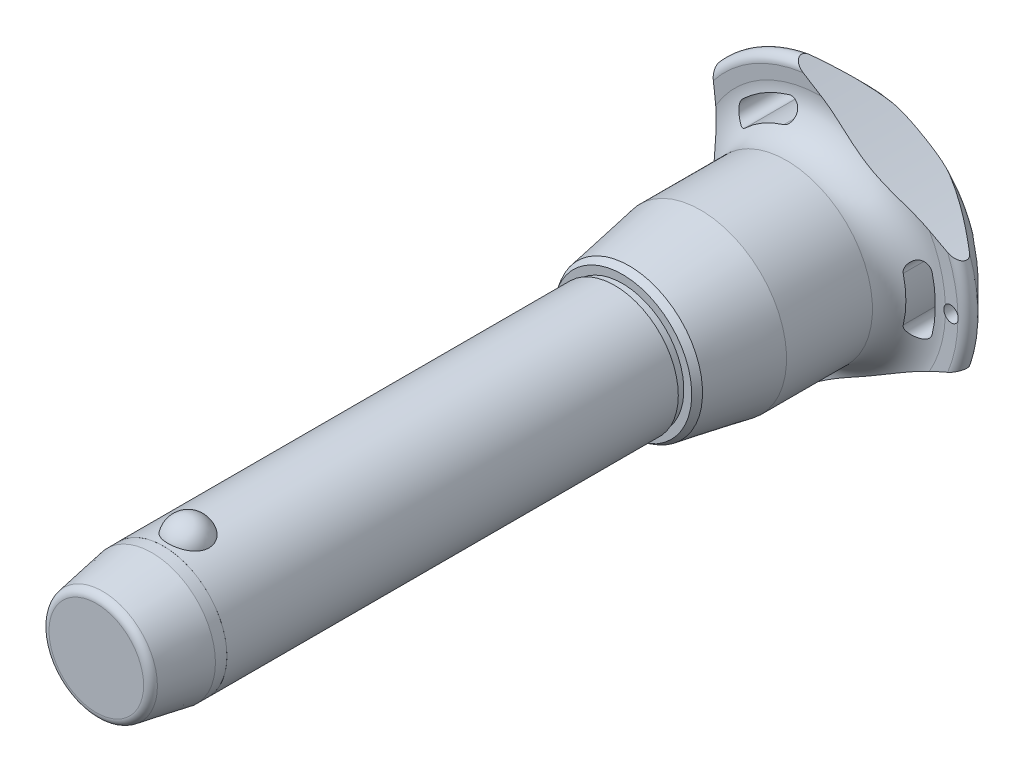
from build123d import *

# Parameters (mm, degrees)
SKETCH1_R           = 12.5
BOSS_EXTRUDE1_DEPTH = 80
SKETCH2_R           = 10
BOSS_EXTRUDE2_DEPTH = 50.7
BOSS_EXTRUDE3_START = 22
SKETCH1_2_R         = 12.5
BOSS_EXTRUDE3_DEPTH = 22
CHAMFER1_SIZE       = 11
CHAMFER1_SIZE2      = 1.939596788
FILLET1_R           = 1.5
SKETCH6_R           = 176.92625
CUT_EXTRUDE1_DEPTH  = 137.79481676
CIRPATTERN1_COUNT   = 3
SKETCH7_R           = 1.5
CUT_EXTRUDE2_DEPTH  = 137.683489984
SKETCH8_R           = 12.5
SKETCH8_R_2         = 12.49
CUT_EXTRUDE3_DEPTH  = 13.2


with BuildPart() as part:
    # Sketch1 → Boss-Extrude1 (new body)
    with BuildSketch(Plane.XY):
        Circle(SKETCH1_R)
    extrude(amount=-BOSS_EXTRUDE1_DEPTH)

    # Sketch2 → Boss-Extrude2 (add)
    with BuildSketch(Plane(origin=(0, 0, -80), x_dir=(-1, 0, 0), z_dir=(0, 0, -1))):
        with Locations(Location((0, 0, 0), (0, 0, 180))):
            Circle(SKETCH2_R)
    extrude(amount=BOSS_EXTRUDE2_DEPTH)

    # Sketch3 → Revolve1 (revolve)
    with BuildSketch(Plane(origin=(0, 0, 0), x_dir=(0, 0, -1), z_dir=(1, 0, 0))):
        with BuildLine():
            Line((-3.957271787, 15.4), (-3.957271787, 7.1))
            ThreePointArc((-3.957271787, 7.1), (0.192728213, 11.25), (-3.957271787, 15.4))
        make_face()
        with BuildLine():
            Line((-3.957271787, -7.1), (-3.957271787, -15.4))
            ThreePointArc((-3.957271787, -15.4), (0.192728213, -11.25), (-3.957271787, -7.1))
        make_face()
    revolve(axis=Axis((0, -7.1, 3.957271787), (0, 1, 0)))

    # Sketch1_2 → Boss-Extrude3 (add)
    with BuildSketch(Plane.XY.offset(BOSS_EXTRUDE3_START)):
        Circle(SKETCH1_2_R)
    extrude(amount=-BOSS_EXTRUDE3_DEPTH)

    # Chamfer1
    chamfer1_edges = [part.edges().sort_by_distance(p)[0] for p in [
        (-12.5, 0, 22),
    ]]
    chamfer1_side = [part.faces().sort_by_distance(p)[0] for p in [
        (-12.5, 0, -29),
    ]]
    chamfer(chamfer1_edges, length=CHAMFER1_SIZE, length2=CHAMFER1_SIZE2, reference=chamfer1_side[0])

    # Fillet1
    fillet1_edges = [part.edges().sort_by_distance(p)[0] for p in [
        (-10.560403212, 0, 22),
        (-10, 0, -130.7),
    ]]
    fillet(fillet1_edges, radius=FILLET1_R)

    # Sketch4 → Revolve2 (revolve)
    with BuildSketch(Plane(origin=(0, 0, 0), x_dir=(0, 0, -1), z_dir=(1, 0, 0)), mode=Mode.PRIVATE) as revolve2_sk:
        Polygon((80, 0), (80, 12.089202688), (81.5, 12.089202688), (81.5, 13.644437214), (82.846872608, 14.422054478), (96.9, 16.9), (113.8, 16.9), (113.8, 0), align=None)
    revolve(revolve2_sk.sketch.rotate(Axis((0, 0, -113.8), (0, 0, 1)), 90), axis=Axis((0, 0, -113.8), (0, 0, 1)))

    # Sketch5 → Revolve3 (revolve)
    with BuildSketch(Plane(origin=(0, 0, 0), x_dir=(0, 0, -1), z_dir=(1, 0, 0)), mode=Mode.PRIVATE) as revolve3_sk:
        with BuildLine():
            Line((120.790129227, 24.271609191), (120.652256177, 26.865060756))
            ThreePointArc((120.652256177, 26.865060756), (121.598671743, 28.411427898), (123.38137085, 28.08137085))
            Line((123.38137085, 28.08137085), (129.763226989, 21.69951471))
            ThreePointArc((129.763226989, 21.69951471), (130.7, 19.381044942), (129.683055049, 17.096604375))
            ThreePointArc((129.683055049, 17.096604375), (124.18864484, 9.321268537), (122.25, 0))
            Line((122.25, 0), (113.8, 0))
            Line((113.8, 0), (113.8, 16.9))
            ThreePointArc((113.8, 16.9), (118.879432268, 19.083427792), (120.790129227, 24.271609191))
        make_face()
    revolve(revolve3_sk.sketch.rotate(Axis((0, 0, -122.25), (0, 0, 1)), 90), axis=Axis((0, 0, -122.25), (0, 0, 1)))

    # Sketch6 → Cut-Extrude1 (cut, through all)
    with BuildSketch(Plane.XY):
        with Locations((-197.42625, 0)):
            Circle(SKETCH6_R)
        with BuildLine():
            ThreePointArc((21.802992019, -5.260839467), (22.428706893, 0), (21.802992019, 5.260839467))
            ThreePointArc((21.802992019, 5.260839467), (19.579234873, 6.620060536), (18.220013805, 4.39630339))
            ThreePointArc((18.220013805, 4.39630339), (18.742902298, 0), (18.220013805, -4.39630339))
            ThreePointArc((18.220013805, -4.39630339), (19.579234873, -6.620060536), (21.802992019, -5.260839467))
        make_face()
    cut_extrude1 = extrude(amount=-CUT_EXTRUDE1_DEPTH, mode=Mode.SUBTRACT)

    # CirPattern1: Cut-Extrude1 ×3 about axis
    cirpattern1_axis = Axis((0, 0, 0), (0, 0, 1))
    for i in range(1, CIRPATTERN1_COUNT):
        add(cut_extrude1.rotate(cirpattern1_axis, i * 360 / CIRPATTERN1_COUNT), mode=Mode.SUBTRACT)

    # Sketch7 → Cut-Extrude2 (cut, through all)
    with BuildSketch(Plane.XY):
        with Locations(Location((25.428706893, 0, 0), (0, 0, 17.230769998))):
            Circle(SKETCH7_R)
    extrude(amount=-CUT_EXTRUDE2_DEPTH, mode=Mode.SUBTRACT)

    # Sketch8 → Cut-Extrude3 (cut)
    with BuildSketch(Plane.XY.offset(22)):
        Circle(SKETCH8_R)
        Circle(SKETCH8_R_2, mode=Mode.SUBTRACT)
    extrude(amount=-CUT_EXTRUDE3_DEPTH, mode=Mode.SUBTRACT)


solid = part.part
